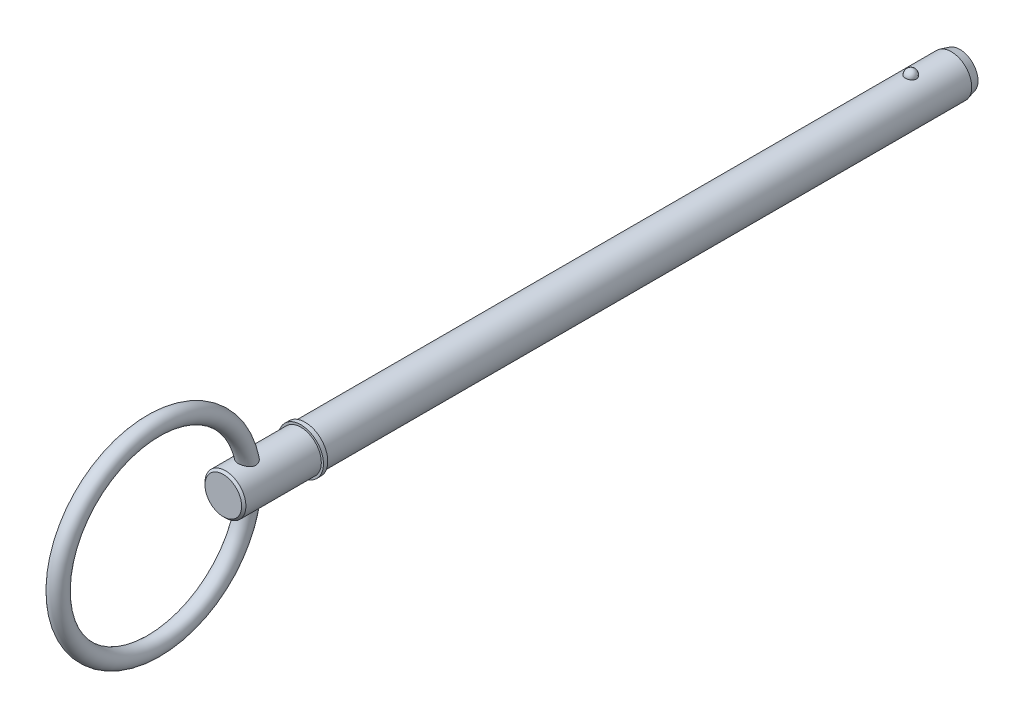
ISO-10303-21;
HEADER;
FILE_DESCRIPTION(('STEP AP214'),'2;1');
FILE_NAME('part.step','',(''),(''),'','','');
FILE_SCHEMA(('AUTOMOTIVE_DESIGN { 1 0 10303 214 1 1 1 1 }'));
ENDSEC;
DATA;
#1=APPLICATION_CONTEXT('core data for automotive mechanical design processes');
#2=APPLICATION_PROTOCOL_DEFINITION('international standard','automotive_design',2000,#1);
#3=PRODUCT_CONTEXT('',#1,'mechanical');
#4=PRODUCT('Part','Part','',(#3));
#5=PRODUCT_RELATED_PRODUCT_CATEGORY('part','',(#4));
#6=PRODUCT_DEFINITION_FORMATION('','',#4);
#7=PRODUCT_DEFINITION_CONTEXT('part definition',#1,'design');
#8=PRODUCT_DEFINITION('design','',#6,#7);
#9=PRODUCT_DEFINITION_SHAPE('','',#8);
#10=(LENGTH_UNIT() NAMED_UNIT(*) SI_UNIT(.MILLI.,.METRE.));
#11=(NAMED_UNIT(*) PLANE_ANGLE_UNIT() SI_UNIT($,.RADIAN.));
#12=(NAMED_UNIT(*) SI_UNIT($,.STERADIAN.) SOLID_ANGLE_UNIT());
#13=UNCERTAINTY_MEASURE_WITH_UNIT(LENGTH_MEASURE(1.E-05),#10,'distance_accuracy_value','');
#14=(GEOMETRIC_REPRESENTATION_CONTEXT(3) GLOBAL_UNCERTAINTY_ASSIGNED_CONTEXT((#13)) GLOBAL_UNIT_ASSIGNED_CONTEXT((#10,
#11,#12)) REPRESENTATION_CONTEXT('',''));
#15=CARTESIAN_POINT('',(0.,0.,0.));
#16=DIRECTION('',(0.,0.,1.));
#17=DIRECTION('',(1.,0.,0.));
#18=AXIS2_PLACEMENT_3D('',#15,#16,#17);
#19=CARTESIAN_POINT('',(0.,0.,139.7));
#20=DIRECTION('',(0.,0.,-1.));
#21=DIRECTION('',(-1.,0.,0.));
#22=AXIS2_PLACEMENT_3D('',#19,#20,#21);
#23=CYLINDRICAL_SURFACE('',#22,4.765);
#24=CARTESIAN_POINT('',(1.27812710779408,4.59038300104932,-1.28999999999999));
#25=CARTESIAN_POINT('',(1.27812572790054,4.59038414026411,-1.21786886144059));
#26=CARTESIAN_POINT('',(1.27223018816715,4.59203736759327,-1.14572000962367));
#27=CARTESIAN_POINT('',(1.24878929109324,4.59846646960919,-1.00346315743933));
#28=CARTESIAN_POINT('',(1.23123896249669,4.60324367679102,-0.933356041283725));
#29=CARTESIAN_POINT('',(1.18493861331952,4.61537801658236,-0.797215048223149));
#30=CARTESIAN_POINT('',(1.15619354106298,4.62273400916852,-0.731179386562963));
#31=CARTESIAN_POINT('',(1.08822596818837,4.6392032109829,-0.604986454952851));
#32=CARTESIAN_POINT('',(1.04900384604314,4.64831635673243,-0.544828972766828));
#33=CARTESIAN_POINT('',(0.960865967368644,4.66733302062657,-0.431775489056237));
#34=CARTESIAN_POINT('',(0.911906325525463,4.67723999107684,-0.378914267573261));
#35=CARTESIAN_POINT('',(0.805678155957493,4.69670280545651,-0.282245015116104));
#36=CARTESIAN_POINT('',(0.748409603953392,4.70625864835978,-0.238437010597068));
#37=CARTESIAN_POINT('',(0.627266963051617,4.72392767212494,-0.161207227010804));
#38=CARTESIAN_POINT('',(0.563411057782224,4.73204466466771,-0.127757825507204));
#39=CARTESIAN_POINT('',(0.430755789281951,4.74595788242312,-0.0720471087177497));
#40=CARTESIAN_POINT('',(0.361956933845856,4.75175434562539,-0.0497846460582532));
#41=CARTESIAN_POINT('',(0.222605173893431,4.76030056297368,-0.0173750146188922));
#42=CARTESIAN_POINT('',(0.152101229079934,4.76309991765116,-0.00703038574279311));
#43=CARTESIAN_POINT('',(0.0103009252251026,4.76551622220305,0.00191361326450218));
#44=CARTESIAN_POINT('',(-0.0609953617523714,4.76513345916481,0.000514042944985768));
#45=CARTESIAN_POINT('',(-0.201348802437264,4.76125496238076,-0.0138891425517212));
#46=CARTESIAN_POINT('',(-0.270423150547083,4.75780093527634,-0.0267372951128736));
#47=CARTESIAN_POINT('',(-0.405377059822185,4.74820737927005,-0.0634598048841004));
#48=CARTESIAN_POINT('',(-0.471256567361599,4.74206780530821,-0.0873343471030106));
#49=CARTESIAN_POINT('',(-0.598375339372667,4.72771507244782,-0.145611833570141));
#50=CARTESIAN_POINT('',(-0.659587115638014,4.71949070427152,-0.180071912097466));
#51=CARTESIAN_POINT('',(-0.775356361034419,4.70185936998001,-0.258542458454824));
#52=CARTESIAN_POINT('',(-0.8299131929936,4.69245229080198,-0.302553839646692));
#53=CARTESIAN_POINT('',(-0.931895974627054,4.67327936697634,-0.399829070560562));
#54=CARTESIAN_POINT('',(-0.979176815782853,4.66351011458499,-0.453244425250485));
#55=CARTESIAN_POINT('',(-1.06421220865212,4.64484426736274,-0.567321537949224));
#56=CARTESIAN_POINT('',(-1.10196613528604,4.63594772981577,-0.627983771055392));
#57=CARTESIAN_POINT('',(-1.16735225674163,4.61992036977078,-0.755585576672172));
#58=CARTESIAN_POINT('',(-1.19487251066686,4.61280933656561,-0.822585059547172));
#59=CARTESIAN_POINT('',(-1.23851975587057,4.60128324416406,-0.960417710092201));
#60=CARTESIAN_POINT('',(-1.25464705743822,4.59686811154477,-1.03125077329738));
#61=CARTESIAN_POINT('',(-1.27505790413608,4.59124882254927,-1.17443804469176));
#62=CARTESIAN_POINT('',(-1.27938868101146,4.59003186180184,-1.246785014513));
#63=CARTESIAN_POINT('',(-1.27623192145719,4.5909105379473,-1.39119892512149));
#64=CARTESIAN_POINT('',(-1.26874468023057,4.59300609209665,-1.46326587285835));
#65=CARTESIAN_POINT('',(-1.24220427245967,4.60025423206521,-1.60473192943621));
#66=CARTESIAN_POINT('',(-1.2232043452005,4.60539274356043,-1.67414176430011));
#67=CARTESIAN_POINT('',(-1.17415910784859,4.61813957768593,-1.80870154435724));
#68=CARTESIAN_POINT('',(-1.1441133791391,4.62574799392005,-1.87385132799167));
#69=CARTESIAN_POINT('',(-1.07354327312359,4.64263368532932,-1.99841604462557));
#70=CARTESIAN_POINT('',(-1.03296580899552,4.65191934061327,-2.05779976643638));
#71=CARTESIAN_POINT('',(-0.942433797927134,4.67110036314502,-2.16881966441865));
#72=CARTESIAN_POINT('',(-0.892478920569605,4.68099575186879,-2.22045556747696));
#73=CARTESIAN_POINT('',(-0.784302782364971,4.70033161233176,-2.31471696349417));
#74=CARTESIAN_POINT('',(-0.726054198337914,4.70977043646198,-2.35731146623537));
#75=CARTESIAN_POINT('',(-0.602997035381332,4.72709995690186,-2.43206620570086));
#76=CARTESIAN_POINT('',(-0.538188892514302,4.73499075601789,-2.46422713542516));
#77=CARTESIAN_POINT('',(-0.404639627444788,4.7482563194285,-2.5168745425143));
#78=CARTESIAN_POINT('',(-0.335953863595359,4.7536596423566,-2.53749415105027));
#79=CARTESIAN_POINT('',(-0.195948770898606,4.76148510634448,-2.5670372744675));
#80=CARTESIAN_POINT('',(-0.124629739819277,4.76390758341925,-2.5759621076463));
#81=CARTESIAN_POINT('',(0.0172696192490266,4.76548774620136,-2.5818033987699));
#82=CARTESIAN_POINT('',(0.0878407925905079,4.76470225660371,-2.57892886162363));
#83=CARTESIAN_POINT('',(0.227467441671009,4.76008019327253,-2.561726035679));
#84=CARTESIAN_POINT('',(0.296522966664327,4.75624371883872,-2.5473981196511));
#85=CARTESIAN_POINT('',(0.430942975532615,4.74595041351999,-2.50776251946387));
#86=CARTESIAN_POINT('',(0.496319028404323,4.7395023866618,-2.4824917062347));
#87=CARTESIAN_POINT('',(0.621860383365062,4.72467083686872,-2.42167301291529));
#88=CARTESIAN_POINT('',(0.682025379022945,4.71628720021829,-2.38612452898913));
#89=CARTESIAN_POINT('',(0.796409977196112,4.69833598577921,-2.30511163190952));
#90=CARTESIAN_POINT('',(0.850529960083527,4.68875291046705,-2.25951003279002));
#91=CARTESIAN_POINT('',(0.950412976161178,4.66953243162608,-2.15992428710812));
#92=CARTESIAN_POINT('',(0.996174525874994,4.65989501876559,-2.1059386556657));
#93=CARTESIAN_POINT('',(1.07885962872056,4.64145616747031,-1.99009376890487));
#94=CARTESIAN_POINT('',(1.11562789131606,4.63267081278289,-1.92812106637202));
#95=CARTESIAN_POINT('',(1.17840570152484,4.61710269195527,-1.79873681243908));
#96=CARTESIAN_POINT('',(1.20441973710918,4.61031909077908,-1.73132754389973));
#97=CARTESIAN_POINT('',(1.24242116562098,4.60021170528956,-1.60192906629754));
#98=CARTESIAN_POINT('',(1.25578772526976,4.59655387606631,-1.54036674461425));
#99=CARTESIAN_POINT('',(1.27364121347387,4.59163904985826,-1.41587409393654));
#100=CARTESIAN_POINT('',(1.2781283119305,4.59038200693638,-1.35294379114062));
#101=CARTESIAN_POINT('',(1.27812710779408,4.59038300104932,-1.28999999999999));
#102=B_SPLINE_CURVE_WITH_KNOTS('',3,(#24,#25,#26,#27,#28,#29,#30,#31,#32,#33,#34,#35,#36,#37,
#38,#39,#40,#41,#42,#43,#44,#45,#46,#47,#48,#49,#50,#51,#52,#53,#54,#55,#56,#57,#58,#59,#60,#61,
#62,#63,#64,#65,#66,#67,#68,#69,#70,#71,#72,#73,#74,#75,#76,#77,#78,#79,#80,#81,#82,#83,#84,#85,
#86,#87,#88,#89,#90,#91,#92,#93,#94,#95,#96,#97,#98,#99,#100,#101),.UNSPECIFIED.,.T.,.F.,(4,2,2,
2,2,2,2,2,2,2,2,2,2,2,2,2,2,2,2,2,2,2,2,2,2,2,2,2,2,2,2,2,2,2,2,2,2,2,4),(0.,0.216167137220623,
0.432426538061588,0.648590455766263,0.864746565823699,1.0818998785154,1.29905382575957,
1.51562361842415,1.73217119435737,1.94507683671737,2.15796327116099,2.36800220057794,
2.57804465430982,2.78924132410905,3.00045819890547,3.21545551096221,3.43046692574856,
3.64776550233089,3.8650581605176,4.08147951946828,4.29789547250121,4.51331818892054,
4.72874907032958,4.94528769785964,5.16183395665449,5.37911087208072,5.59637335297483,
5.8110751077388,6.02575265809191,6.23664413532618,6.44752874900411,6.65770827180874,
6.86790014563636,7.08116060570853,7.29445887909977,7.51121476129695,7.72788009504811,
7.91651762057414,8.10515153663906),.UNSPECIFIED.);
#103=CARTESIAN_POINT('',(1.27812710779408,4.59038300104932,-1.28999999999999));
#104=VERTEX_POINT('',#103);
#105=EDGE_CURVE('E102',#104,#104,#102,.T.);
#106=ORIENTED_EDGE('',*,*,#105,.T.);
#107=EDGE_LOOP('',(#106));
#108=FACE_BOUND('',#107,.T.);
#109=CARTESIAN_POINT('',(0.,0.,-10.6999999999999));
#110=DIRECTION('',(0.,0.,-1.));
#111=DIRECTION('',(-1.,0.,0.));
#112=AXIS2_PLACEMENT_3D('',#109,#110,#111);
#113=CIRCLE('',#112,4.765);
#114=CARTESIAN_POINT('',(-4.765,0.,-10.6999999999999));
#115=VERTEX_POINT('',#114);
#116=EDGE_CURVE('E109',#115,#115,#113,.F.);
#117=ORIENTED_EDGE('',*,*,#116,.T.);
#118=EDGE_LOOP('',(#117));
#119=FACE_BOUND('',#118,.T.);
#120=CARTESIAN_POINT('',(0.,0.,139.7));
#121=DIRECTION('',(0.,0.,1.));
#122=DIRECTION('',(1.,0.,0.));
#123=AXIS2_PLACEMENT_3D('',#120,#121,#122);
#124=CIRCLE('',#123,4.765);
#125=CARTESIAN_POINT('',(4.765,0.,139.7));
#126=VERTEX_POINT('',#125);
#127=EDGE_CURVE('E107',#126,#126,#124,.T.);
#128=ORIENTED_EDGE('',*,*,#127,.F.);
#129=EDGE_LOOP('',(#128));
#130=FACE_BOUND('',#129,.T.);
#131=ADVANCED_FACE('F39',(#108,#119,#130),#23,.T.);
#132=CARTESIAN_POINT('',(0.,0.,-12.7));
#133=DIRECTION('',(0.,0.,-1.));
#134=DIRECTION('',(-1.,0.,0.));
#135=AXIS2_PLACEMENT_3D('',#132,#133,#134);
#136=PLANE('',#135);
#137=CARTESIAN_POINT('',(0.,0.,-12.7));
#138=DIRECTION('',(0.,0.,-1.));
#139=DIRECTION('',(-1.,0.,0.));
#140=AXIS2_PLACEMENT_3D('',#137,#138,#139);
#141=CIRCLE('',#140,4.22910161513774);
#142=CARTESIAN_POINT('',(-4.22910161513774,0.,-12.7));
#143=VERTEX_POINT('',#142);
#144=EDGE_CURVE('E141',#143,#143,#141,.T.);
#145=ORIENTED_EDGE('',*,*,#144,.T.);
#146=EDGE_LOOP('',(#145));
#147=FACE_BOUND('',#146,.T.);
#148=ADVANCED_FACE('F88',(#147),#136,.T.);
#149=CARTESIAN_POINT('',(0.,0.,-12.7));
#150=DIRECTION('',(0.,0.,1.));
#151=DIRECTION('',(1.,0.,0.));
#152=AXIS2_PLACEMENT_3D('',#149,#150,#151);
#153=CONICAL_SURFACE('',#152,4.22910161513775,0.261799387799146);
#154=ORIENTED_EDGE('',*,*,#116,.F.);
#155=EDGE_LOOP('',(#154));
#156=FACE_BOUND('',#155,.T.);
#157=ORIENTED_EDGE('',*,*,#144,.F.);
#158=EDGE_LOOP('',(#157));
#159=FACE_BOUND('',#158,.T.);
#160=ADVANCED_FACE('F94',(#156,#159),#153,.T.);
#161=CARTESIAN_POINT('',(0.,4.765,-1.28999999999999));
#162=DIRECTION('',(0.,1.,0.));
#163=DIRECTION('',(0.,0.,-1.));
#164=AXIS2_PLACEMENT_3D('',#161,#162,#163);
#165=SPHERICAL_SURFACE('',#164,1.29);
#166=ORIENTED_EDGE('',*,*,#105,.F.);
#167=EDGE_LOOP('',(#166));
#168=FACE_BOUND('',#167,.T.);
#169=ADVANCED_FACE('F112',(#168),#165,.T.);
#170=CARTESIAN_POINT('',(0.,0.,139.7));
#171=DIRECTION('',(0.,0.,-1.));
#172=DIRECTION('',(-1.,0.,0.));
#173=AXIS2_PLACEMENT_3D('',#170,#171,#172);
#174=PLANE('',#173);
#175=ORIENTED_EDGE('',*,*,#127,.T.);
#176=EDGE_LOOP('',(#175));
#177=FACE_BOUND('',#176,.T.);
#178=CARTESIAN_POINT('',(0.,0.,139.7));
#179=DIRECTION('',(0.,0.,-1.));
#180=DIRECTION('',(-1.,0.,0.));
#181=AXIS2_PLACEMENT_3D('',#178,#179,#180);
#182=CIRCLE('',#181,5.265);
#183=CARTESIAN_POINT('',(-5.265,0.,139.7));
#184=VERTEX_POINT('',#183);
#185=EDGE_CURVE('E108',#184,#184,#182,.T.);
#186=ORIENTED_EDGE('',*,*,#185,.T.);
#187=EDGE_LOOP('',(#186));
#188=FACE_BOUND('',#187,.T.);
#189=ADVANCED_FACE('F116',(#177,#188),#174,.T.);
#190=CARTESIAN_POINT('',(0.,0.,33.7287874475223));
#191=DIRECTION('',(0.,0.,-1.));
#192=DIRECTION('',(-1.,0.,0.));
#193=AXIS2_PLACEMENT_3D('',#190,#191,#192);
#194=CYLINDRICAL_SURFACE('',#193,5.265);
#195=CARTESIAN_POINT('',(0.,0.,140.7));
#196=DIRECTION('',(0.,0.,-1.));
#197=DIRECTION('',(-1.,0.,0.));
#198=AXIS2_PLACEMENT_3D('',#195,#196,#197);
#199=CIRCLE('',#198,5.265);
#200=CARTESIAN_POINT('',(-5.265,0.,140.7));
#201=VERTEX_POINT('',#200);
#202=EDGE_CURVE('E133',#201,#201,#199,.T.);
#203=ORIENTED_EDGE('',*,*,#202,.T.);
#204=EDGE_LOOP('',(#203));
#205=FACE_BOUND('',#204,.T.);
#206=ORIENTED_EDGE('',*,*,#185,.F.);
#207=EDGE_LOOP('',(#206));
#208=FACE_BOUND('',#207,.T.);
#209=ADVANCED_FACE('F120',(#205,#208),#194,.T.);
#210=CARTESIAN_POINT('',(0.,5.265,140.7));
#211=DIRECTION('',(0.,0.,1.));
#212=DIRECTION('',(1.,0.,0.));
#213=AXIS2_PLACEMENT_3D('',#210,#211,#212);
#214=PLANE('',#213);
#215=CARTESIAN_POINT('',(0.,0.,140.7));
#216=DIRECTION('',(0.,0.,1.));
#217=DIRECTION('',(1.,0.,0.));
#218=AXIS2_PLACEMENT_3D('',#215,#216,#217);
#219=CIRCLE('',#218,4.765);
#220=CARTESIAN_POINT('',(4.765,0.,140.7));
#221=VERTEX_POINT('',#220);
#222=EDGE_CURVE('E111',#221,#221,#219,.T.);
#223=ORIENTED_EDGE('',*,*,#222,.F.);
#224=EDGE_LOOP('',(#223));
#225=FACE_BOUND('',#224,.T.);
#226=ORIENTED_EDGE('',*,*,#202,.F.);
#227=EDGE_LOOP('',(#226));
#228=FACE_BOUND('',#227,.T.);
#229=ADVANCED_FACE('F85',(#225,#228),#214,.T.);
#230=CARTESIAN_POINT('',(0.,0.,158.75));
#231=DIRECTION('',(0.,0.,-1.));
#232=DIRECTION('',(-1.,0.,0.));
#233=AXIS2_PLACEMENT_3D('',#230,#231,#232);
#234=CYLINDRICAL_SURFACE('',#233,4.765);
#235=CARTESIAN_POINT('',(-1.17603588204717,-4.61759294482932,151.58372006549));
#236=CARTESIAN_POINT('',(-1.08605054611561,-4.6405075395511,151.5215688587));
#237=CARTESIAN_POINT('',(-0.990486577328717,-4.66202408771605,151.46673933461));
#238=CARTESIAN_POINT('',(-0.790762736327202,-4.70002969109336,151.372995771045));
#239=CARTESIAN_POINT('',(-0.686587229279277,-4.7165093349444,151.334111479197));
#240=CARTESIAN_POINT('',(-0.472539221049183,-4.7427361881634,151.273267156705));
#241=CARTESIAN_POINT('',(-0.362665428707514,-4.7524818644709,151.251310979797));
#242=CARTESIAN_POINT('',(-0.140482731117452,-4.7642267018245,151.224936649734));
#243=CARTESIAN_POINT('',(-0.0281752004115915,-4.7662301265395,151.220508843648));
#244=CARTESIAN_POINT('',(0.193745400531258,-4.76233166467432,151.229208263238));
#245=CARTESIAN_POINT('',(0.303372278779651,-4.75656024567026,151.242045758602));
#246=CARTESIAN_POINT('',(0.518724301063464,-4.73791484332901,151.284434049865));
#247=CARTESIAN_POINT('',(0.624448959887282,-4.72503997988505,151.313986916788));
#248=CARTESIAN_POINT('',(0.829434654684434,-4.69340588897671,151.38920858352));
#249=CARTESIAN_POINT('',(0.928674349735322,-4.6746283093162,151.434927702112));
#250=CARTESIAN_POINT('',(1.11777413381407,-4.6330539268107,151.541473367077));
#251=CARTESIAN_POINT('',(1.20763216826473,-4.61025624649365,151.602303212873));
#252=CARTESIAN_POINT('',(1.37762760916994,-4.56238439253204,151.73943936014));
#253=CARTESIAN_POINT('',(1.45749020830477,-4.53726959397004,151.81607281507));
#254=CARTESIAN_POINT('',(1.60275140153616,-4.48801828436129,151.982293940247));
#255=CARTESIAN_POINT('',(1.66815155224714,-4.46388166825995,152.071880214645));
#256=CARTESIAN_POINT('',(1.78162069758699,-4.41980966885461,152.260468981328));
#257=CARTESIAN_POINT('',(1.82993675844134,-4.3998162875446,152.359308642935));
#258=CARTESIAN_POINT('',(1.90902953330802,-4.3660853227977,152.564739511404));
#259=CARTESIAN_POINT('',(1.93981696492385,-4.35234391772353,152.671325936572));
#260=CARTESIAN_POINT('',(1.9818112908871,-4.33337618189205,152.882380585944));
#261=CARTESIAN_POINT('',(1.99406945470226,-4.32769391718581,152.98660066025));
#262=CARTESIAN_POINT('',(2.0025484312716,-4.32377679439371,153.195812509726));
#263=CARTESIAN_POINT('',(1.99876733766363,-4.32554282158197,153.300804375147));
#264=CARTESIAN_POINT('',(1.97595504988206,-4.33600911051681,153.509105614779));
#265=CARTESIAN_POINT('',(1.95686739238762,-4.3447350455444,153.612407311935));
#266=CARTESIAN_POINT('',(1.90457346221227,-4.36790947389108,153.814679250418));
#267=CARTESIAN_POINT('',(1.87136191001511,-4.38236010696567,153.913647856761));
#268=CARTESIAN_POINT('',(1.78747856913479,-4.4172881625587,154.116470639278));
#269=CARTESIAN_POINT('',(1.73524632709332,-4.43826528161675,154.219592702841));
#270=CARTESIAN_POINT('',(1.61607256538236,-4.48303292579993,154.416386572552));
#271=CARTESIAN_POINT('',(1.54911576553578,-4.50682636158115,154.510048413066));
#272=CARTESIAN_POINT('',(1.39359064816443,-4.55746895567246,154.695383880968));
#273=CARTESIAN_POINT('',(1.30346928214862,-4.5843706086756,154.785750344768));
#274=CARTESIAN_POINT('',(1.10794390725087,-4.63549850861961,154.949011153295));
#275=CARTESIAN_POINT('',(1.00255934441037,-4.65972809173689,155.021927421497));
#276=CARTESIAN_POINT('',(0.803761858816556,-4.69755503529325,155.132407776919));
#277=CARTESIAN_POINT('',(0.712935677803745,-4.71231838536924,155.174230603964));
#278=CARTESIAN_POINT('',(0.525172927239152,-4.73691370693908,155.242936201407));
#279=CARTESIAN_POINT('',(0.428242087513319,-4.7467502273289,155.269832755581));
#280=CARTESIAN_POINT('',(0.230351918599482,-4.76046566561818,155.307147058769));
#281=CARTESIAN_POINT('',(0.129376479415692,-4.76431768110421,155.317490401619));
#282=CARTESIAN_POINT('',(-0.0728965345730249,-4.76551495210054,155.320716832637));
#283=CARTESIAN_POINT('',(-0.174194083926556,-4.76286070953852,155.31360126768));
#284=CARTESIAN_POINT('',(-0.366467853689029,-4.751792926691,155.283579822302));
#285=CARTESIAN_POINT('',(-0.457659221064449,-4.74381187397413,155.261858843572));
#286=CARTESIAN_POINT('',(-0.635226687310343,-4.72331548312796,155.205084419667));
#287=CARTESIAN_POINT('',(-0.721601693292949,-4.71079912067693,155.170027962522));
#288=CARTESIAN_POINT('',(-0.893212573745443,-4.68139468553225,155.085559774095));
#289=CARTESIAN_POINT('',(-0.978027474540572,-4.66427939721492,155.035377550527));
#290=CARTESIAN_POINT('',(-1.13917803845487,-4.62756330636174,154.923642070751));
#291=CARTESIAN_POINT('',(-1.21550961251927,-4.6079613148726,154.862083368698));
#292=CARTESIAN_POINT('',(-1.37033540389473,-4.56452178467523,154.71868852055));
#293=CARTESIAN_POINT('',(-1.44723650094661,-4.5405070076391,154.635184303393));
#294=CARTESIAN_POINT('',(-1.58763850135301,-4.49334232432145,154.457292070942));
#295=CARTESIAN_POINT('',(-1.65112672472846,-4.47019325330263,154.362893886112));
#296=CARTESIAN_POINT('',(-1.77033243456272,-4.42444393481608,154.153206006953));
#297=CARTESIAN_POINT('',(-1.82420433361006,-4.40224259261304,154.036768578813));
#298=CARTESIAN_POINT('',(-1.91169086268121,-4.36496831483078,153.795409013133));
#299=CARTESIAN_POINT('',(-1.94531523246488,-4.34989195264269,153.670490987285));
#300=CARTESIAN_POINT('',(-1.98892523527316,-4.33012255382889,153.422016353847));
#301=CARTESIAN_POINT('',(-1.99998275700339,-4.32495941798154,153.298689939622));
#302=CARTESIAN_POINT('',(-2.00001713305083,-4.32494814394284,153.052073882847));
#303=CARTESIAN_POINT('',(-1.98902141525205,-4.33008719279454,152.928784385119));
#304=CARTESIAN_POINT('',(-1.94752572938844,-4.34888267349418,152.70321378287));
#305=CARTESIAN_POINT('',(-1.9197975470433,-4.36132278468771,152.600310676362));
#306=CARTESIAN_POINT('',(-1.84805595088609,-4.39220107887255,152.401251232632));
#307=CARTESIAN_POINT('',(-1.80403476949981,-4.4106421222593,152.305098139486));
#308=CARTESIAN_POINT('',(-1.7023200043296,-4.4508689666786,152.124457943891));
#309=CARTESIAN_POINT('',(-1.64499853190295,-4.47255887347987,152.039738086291));
#310=CARTESIAN_POINT('',(-1.51770958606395,-4.51733419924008,151.881012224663));
#311=CARTESIAN_POINT('',(-1.44776268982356,-4.54041730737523,151.806989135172));
#312=CARTESIAN_POINT('',(-1.34143544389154,-4.57239833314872,151.71104340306));
#313=CARTESIAN_POINT('',(-1.30955259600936,-4.58164274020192,151.684115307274));
#314=CARTESIAN_POINT('',(-1.24406394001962,-4.59985727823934,151.632340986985));
#315=CARTESIAN_POINT('',(-1.21045807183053,-4.6088273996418,151.60749483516));
#316=CARTESIAN_POINT('',(-1.17603588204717,-4.61759294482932,151.58372006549));
#317=B_SPLINE_CURVE_WITH_KNOTS('',3,(#235,#236,#237,#238,#239,#240,#241,#242,#243,#244,#245,
#246,#247,#248,#249,#250,#251,#252,#253,#254,#255,#256,#257,#258,#259,#260,#261,#262,#263,#264,
#265,#266,#267,#268,#269,#270,#271,#272,#273,#274,#275,#276,#277,#278,#279,#280,#281,#282,#283,
#284,#285,#286,#287,#288,#289,#290,#291,#292,#293,#294,#295,#296,#297,#298,#299,#300,#301,#302,
#303,#304,#305,#306,#307,#308,#309,#310,#311,#312,#313,#314,#315,#316),.UNSPECIFIED.,.T.,.F.,(4,
2,2,2,2,2,2,2,2,2,2,2,2,2,2,2,2,2,2,2,2,2,2,2,2,2,2,2,2,2,2,2,2,2,2,2,2,2,2,2,4),(0.,
0.335054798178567,0.670731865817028,1.00648532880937,1.34205386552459,1.67206089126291,
2.00210881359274,2.33319321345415,2.66434996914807,3.00321157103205,3.34203668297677,
3.67573940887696,4.00923787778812,4.32299322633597,4.63678586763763,4.95174139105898,
5.26681474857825,5.61785759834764,5.96926647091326,6.35862694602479,6.74749565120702,
7.04947204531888,7.35116911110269,7.65421852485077,7.95724456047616,8.23825252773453,
8.51932400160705,8.81825171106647,9.11732288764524,9.46404422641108,9.81109188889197,
10.1997682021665,10.5882573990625,10.9578189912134,11.32692124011,11.6472091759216,
11.9676500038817,12.2800235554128,12.5918925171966,12.7200569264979,12.8482258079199),.UNSPECIFIED.);
#318=CARTESIAN_POINT('',(-1.17603588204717,-4.61759294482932,151.58372006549));
#319=VERTEX_POINT('',#318);
#320=EDGE_CURVE('E10',#319,#319,#317,.T.);
#321=ORIENTED_EDGE('',*,*,#320,.F.);
#322=EDGE_LOOP('',(#321));
#323=FACE_BOUND('',#322,.T.);
#324=CARTESIAN_POINT('',(-1.17603588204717,4.61759294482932,151.58372006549));
#325=CARTESIAN_POINT('',(-1.26499234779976,4.59493450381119,151.645169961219));
#326=CARTESIAN_POINT('',(-1.34870034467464,4.57085993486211,151.713915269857));
#327=CARTESIAN_POINT('',(-1.50334626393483,4.52236448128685,151.864635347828));
#328=CARTESIAN_POINT('',(-1.57425996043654,4.49794303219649,151.94663466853));
#329=CARTESIAN_POINT('',(-1.70130187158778,4.45144771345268,152.122234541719));
#330=CARTESIAN_POINT('',(-1.75740699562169,4.42937754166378,152.21585288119));
#331=CARTESIAN_POINT('',(-1.8528775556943,4.3903018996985,152.4121668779));
#332=CARTESIAN_POINT('',(-1.89225871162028,4.37329167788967,152.514853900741));
#333=CARTESIAN_POINT('',(-1.95188661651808,4.34699775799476,152.721857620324));
#334=CARTESIAN_POINT('',(-1.97286468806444,4.33742068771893,152.825926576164));
#335=CARTESIAN_POINT('',(-1.99814509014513,4.32583397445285,153.036471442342));
#336=CARTESIAN_POINT('',(-2.00244696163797,4.32382453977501,153.142947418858));
#337=CARTESIAN_POINT('',(-1.9949990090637,4.32726361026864,153.352770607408));
#338=CARTESIAN_POINT('',(-1.98360617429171,4.33254625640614,153.456134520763));
#339=CARTESIAN_POINT('',(-1.94643618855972,4.34936983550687,153.659691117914));
#340=CARTESIAN_POINT('',(-1.92065444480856,4.3609127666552,153.759882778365));
#341=CARTESIAN_POINT('',(-1.85292379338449,4.3901452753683,153.96410420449));
#342=CARTESIAN_POINT('',(-1.80971134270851,4.40830066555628,154.067646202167));
#343=CARTESIAN_POINT('',(-1.7089274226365,4.44833985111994,154.266768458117));
#344=CARTESIAN_POINT('',(-1.6513428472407,4.4702270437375,154.362341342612));
#345=CARTESIAN_POINT('',(-1.51475300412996,4.51847764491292,154.555260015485));
#346=CARTESIAN_POINT('',(-1.43395667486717,4.54505660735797,154.651291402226));
#347=CARTESIAN_POINT('',(-1.25684082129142,4.59718102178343,154.828132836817));
#348=CARTESIAN_POINT('',(-1.16053129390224,4.62272712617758,154.908952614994));
#349=CARTESIAN_POINT('',(-0.972192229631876,4.66558476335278,155.039326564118));
#350=CARTESIAN_POINT('',(-0.882391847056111,4.68355428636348,155.091879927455));
#351=CARTESIAN_POINT('',(-0.694836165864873,4.71502283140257,155.182022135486));
#352=CARTESIAN_POINT('',(-0.597087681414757,4.72852563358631,155.219623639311));
#353=CARTESIAN_POINT('',(-0.395321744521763,4.74966109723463,155.277875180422));
#354=CARTESIAN_POINT('',(-0.291269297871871,4.75725698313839,155.298419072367));
#355=CARTESIAN_POINT('',(-0.0808979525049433,4.76547327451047,155.320624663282));
#356=CARTESIAN_POINT('',(0.0254198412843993,4.76609700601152,155.32229536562));
#357=CARTESIAN_POINT('',(0.225327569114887,4.7606097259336,155.307485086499));
#358=CARTESIAN_POINT('',(0.319084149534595,4.75519734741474,155.292887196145));
#359=CARTESIAN_POINT('',(0.502750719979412,4.73930039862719,155.249397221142));
#360=CARTESIAN_POINT('',(0.59266009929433,4.72881502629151,155.220502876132));
#361=CARTESIAN_POINT('',(0.768777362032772,4.70343779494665,155.14904136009));
#362=CARTESIAN_POINT('',(0.854839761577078,4.68844387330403,155.106155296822));
#363=CARTESIAN_POINT('',(1.01943666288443,4.65543047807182,155.008746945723));
#364=CARTESIAN_POINT('',(1.09796821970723,4.63740982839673,154.954220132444));
#365=CARTESIAN_POINT('',(1.2575182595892,4.59691257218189,154.826465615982));
#366=CARTESIAN_POINT('',(1.33721103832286,4.57417011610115,154.751667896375));
#367=CARTESIAN_POINT('',(1.48461190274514,4.52847869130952,154.591082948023));
#368=CARTESIAN_POINT('',(1.55230949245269,4.50552956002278,154.505286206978));
#369=CARTESIAN_POINT('',(1.68366050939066,4.45825797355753,154.311404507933));
#370=CARTESIAN_POINT('',(1.74532014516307,4.4342153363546,154.201889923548));
#371=CARTESIAN_POINT('',(1.85007805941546,4.39154308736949,153.973269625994));
#372=CARTESIAN_POINT('',(1.89317429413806,4.37291407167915,153.854162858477));
#373=CARTESIAN_POINT('',(1.958572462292,4.34402041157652,153.609763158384));
#374=CARTESIAN_POINT('',(1.98095022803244,4.33372528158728,153.484494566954));
#375=CARTESIAN_POINT('',(2.00301292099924,4.32358016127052,153.231594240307));
#376=CARTESIAN_POINT('',(2.00273000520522,4.32371536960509,153.103966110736));
#377=CARTESIAN_POINT('',(1.9799756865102,4.3341693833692,152.868247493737));
#378=CARTESIAN_POINT('',(1.96044562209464,4.34313814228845,152.759806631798));
#379=CARTESIAN_POINT('',(1.90368145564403,4.36831534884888,152.548543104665));
#380=CARTESIAN_POINT('',(1.86644884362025,4.38452318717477,152.445719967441));
#381=CARTESIAN_POINT('',(1.77811542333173,4.42104679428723,152.25471002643));
#382=CARTESIAN_POINT('',(1.7279770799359,4.44105894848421,152.166015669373));
#383=CARTESIAN_POINT('',(1.61439500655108,4.48359504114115,151.998286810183));
#384=CARTESIAN_POINT('',(1.55094927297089,4.50611935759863,151.919253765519));
#385=CARTESIAN_POINT('',(1.40889349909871,4.55259151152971,151.768705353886));
#386=CARTESIAN_POINT('',(1.32968750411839,4.57655455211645,151.697757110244));
#387=CARTESIAN_POINT('',(1.16035884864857,4.62238936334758,151.569506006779));
#388=CARTESIAN_POINT('',(1.07023361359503,4.64426063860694,151.51220637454));
#389=CARTESIAN_POINT('',(0.877362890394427,4.68460759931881,151.410316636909));
#390=CARTESIAN_POINT('',(0.774249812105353,4.70290564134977,151.366349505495));
#391=CARTESIAN_POINT('',(0.561430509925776,4.73302876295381,151.295484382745));
#392=CARTESIAN_POINT('',(0.451725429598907,4.74485496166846,151.268583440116));
#393=CARTESIAN_POINT('',(0.230282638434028,4.76071009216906,151.232763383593));
#394=CARTESIAN_POINT('',(0.118587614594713,4.76483485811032,151.223623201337));
#395=CARTESIAN_POINT('',(-0.10491160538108,4.76515532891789,151.222908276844));
#396=CARTESIAN_POINT('',(-0.216715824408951,4.76134861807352,151.231338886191));
#397=CARTESIAN_POINT('',(-0.435231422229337,4.74632552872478,151.26524563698));
#398=CARTESIAN_POINT('',(-0.541996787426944,4.73523460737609,151.290433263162));
#399=CARTESIAN_POINT('',(-0.749371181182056,4.70686626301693,151.356921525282));
#400=CARTESIAN_POINT('',(-0.849990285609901,4.68959930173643,151.398194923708));
#401=CARTESIAN_POINT('',(-0.986108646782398,4.66202614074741,151.467235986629));
#402=CARTESIAN_POINT('',(-1.02525769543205,4.65355983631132,151.488772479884));
#403=CARTESIAN_POINT('',(-1.10191286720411,4.63600664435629,151.534367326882));
#404=CARTESIAN_POINT('',(-1.13941901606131,4.62691976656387,151.558425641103));
#405=CARTESIAN_POINT('',(-1.17603588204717,4.61759294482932,151.58372006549));
#406=B_SPLINE_CURVE_WITH_KNOTS('',3,(#324,#325,#326,#327,#328,#329,#330,#331,#332,#333,#334,
#335,#336,#337,#338,#339,#340,#341,#342,#343,#344,#345,#346,#347,#348,#349,#350,#351,#352,#353,
#354,#355,#356,#357,#358,#359,#360,#361,#362,#363,#364,#365,#366,#367,#368,#369,#370,#371,#372,
#373,#374,#375,#376,#377,#378,#379,#380,#381,#382,#383,#384,#385,#386,#387,#388,#389,#390,#391,
#392,#393,#394,#395,#396,#397,#398,#399,#400,#401,#402,#403,#404,#405),.UNSPECIFIED.,.T.,.F.,(4,
2,2,2,2,2,2,2,2,2,2,2,2,2,2,2,2,2,2,2,2,2,2,2,2,2,2,2,2,2,2,2,2,2,2,2,2,2,2,2,4),(0.,
0.331234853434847,0.663090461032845,0.99546050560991,1.3275174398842,1.64568783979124,
1.96386699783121,2.27492717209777,2.5860866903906,2.92571998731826,3.26566413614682,
3.64875195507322,4.03159388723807,4.34706664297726,4.66227172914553,4.97942386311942,
5.29642469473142,5.58021908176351,5.86405835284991,6.15488068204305,6.44581627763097,
6.77943874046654,7.11335170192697,7.4954566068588,7.8776035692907,8.25834622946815,
8.63854860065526,8.96843568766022,9.29829501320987,9.6084287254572,9.91860916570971,
10.2441707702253,10.5698092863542,10.9089029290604,11.2479379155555,11.5827251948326,
11.9176144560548,12.2468820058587,12.5755944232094,12.7119417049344,12.8482868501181),.UNSPECIFIED.);
#407=CARTESIAN_POINT('',(-1.17603588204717,4.61759294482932,151.58372006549));
#408=VERTEX_POINT('',#407);
#409=EDGE_CURVE('E51',#408,#408,#406,.T.);
#410=ORIENTED_EDGE('',*,*,#409,.F.);
#411=EDGE_LOOP('',(#410));
#412=FACE_BOUND('',#411,.T.);
#413=CARTESIAN_POINT('',(0.,0.,158.25));
#414=DIRECTION('',(0.,0.,-1.));
#415=DIRECTION('',(-1.,0.,0.));
#416=AXIS2_PLACEMENT_3D('',#413,#414,#415);
#417=CIRCLE('',#416,4.765);
#418=CARTESIAN_POINT('',(-4.765,0.,158.25));
#419=VERTEX_POINT('',#418);
#420=EDGE_CURVE('E64',#419,#419,#417,.T.);
#421=ORIENTED_EDGE('',*,*,#420,.T.);
#422=EDGE_LOOP('',(#421));
#423=FACE_BOUND('',#422,.T.);
#424=ORIENTED_EDGE('',*,*,#222,.T.);
#425=EDGE_LOOP('',(#424));
#426=FACE_BOUND('',#425,.T.);
#427=ADVANCED_FACE('F69',(#323,#412,#423,#426),#234,.T.);
#428=CARTESIAN_POINT('',(0.,0.,158.75));
#429=DIRECTION('',(0.,0.,-1.));
#430=DIRECTION('',(-1.,0.,0.));
#431=AXIS2_PLACEMENT_3D('',#428,#429,#430);
#432=PLANE('',#431);
#433=CARTESIAN_POINT('',(0.,0.,158.75));
#434=DIRECTION('',(0.,0.,-1.));
#435=DIRECTION('',(-1.,0.,0.));
#436=AXIS2_PLACEMENT_3D('',#433,#434,#435);
#437=CIRCLE('',#436,4.26499999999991);
#438=CARTESIAN_POINT('',(-4.26499999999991,0.,158.75));
#439=VERTEX_POINT('',#438);
#440=EDGE_CURVE('E57',#439,#439,#437,.F.);
#441=ORIENTED_EDGE('',*,*,#440,.T.);
#442=EDGE_LOOP('',(#441));
#443=FACE_BOUND('',#442,.T.);
#444=ADVANCED_FACE('F76',(#443),#432,.F.);
#445=CARTESIAN_POINT('',(0.,0.,158.25));
#446=DIRECTION('',(0.,0.,-1.));
#447=DIRECTION('',(-1.,0.,0.));
#448=AXIS2_PLACEMENT_3D('',#445,#446,#447);
#449=CONICAL_SURFACE('',#448,4.765,0.785398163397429);
#450=ORIENTED_EDGE('',*,*,#440,.F.);
#451=EDGE_LOOP('',(#450));
#452=FACE_BOUND('',#451,.T.);
#453=ORIENTED_EDGE('',*,*,#420,.F.);
#454=EDGE_LOOP('',(#453));
#455=FACE_BOUND('',#454,.T.);
#456=ADVANCED_FACE('F41',(#452,#455),#449,.T.);
#457=CARTESIAN_POINT('',(0.,0.,174.975));
#458=DIRECTION('',(1.,0.,0.));
#459=DIRECTION('',(0.,0.,-1.));
#460=AXIS2_PLACEMENT_3D('',#457,#458,#459);
#461=TOROIDAL_SURFACE('',#460,22.225,2.);
#462=ORIENTED_EDGE('',*,*,#320,.T.);
#463=EDGE_LOOP('',(#462));
#464=FACE_BOUND('',#463,.T.);
#465=ORIENTED_EDGE('',*,*,#409,.T.);
#466=EDGE_LOOP('',(#465));
#467=FACE_BOUND('',#466,.T.);
#468=ADVANCED_FACE('F73',(#464,#467),#461,.T.);
#469=CLOSED_SHELL('',(#131,#148,#160,#169,#189,#209,#229,#427,#444,#456,#468));
#470=MANIFOLD_SOLID_BREP('B2',#469);
#471=ADVANCED_BREP_SHAPE_REPRESENTATION('',(#18,#470),#14);
#472=SHAPE_DEFINITION_REPRESENTATION(#9,#471);
ENDSEC;
END-ISO-10303-21;
